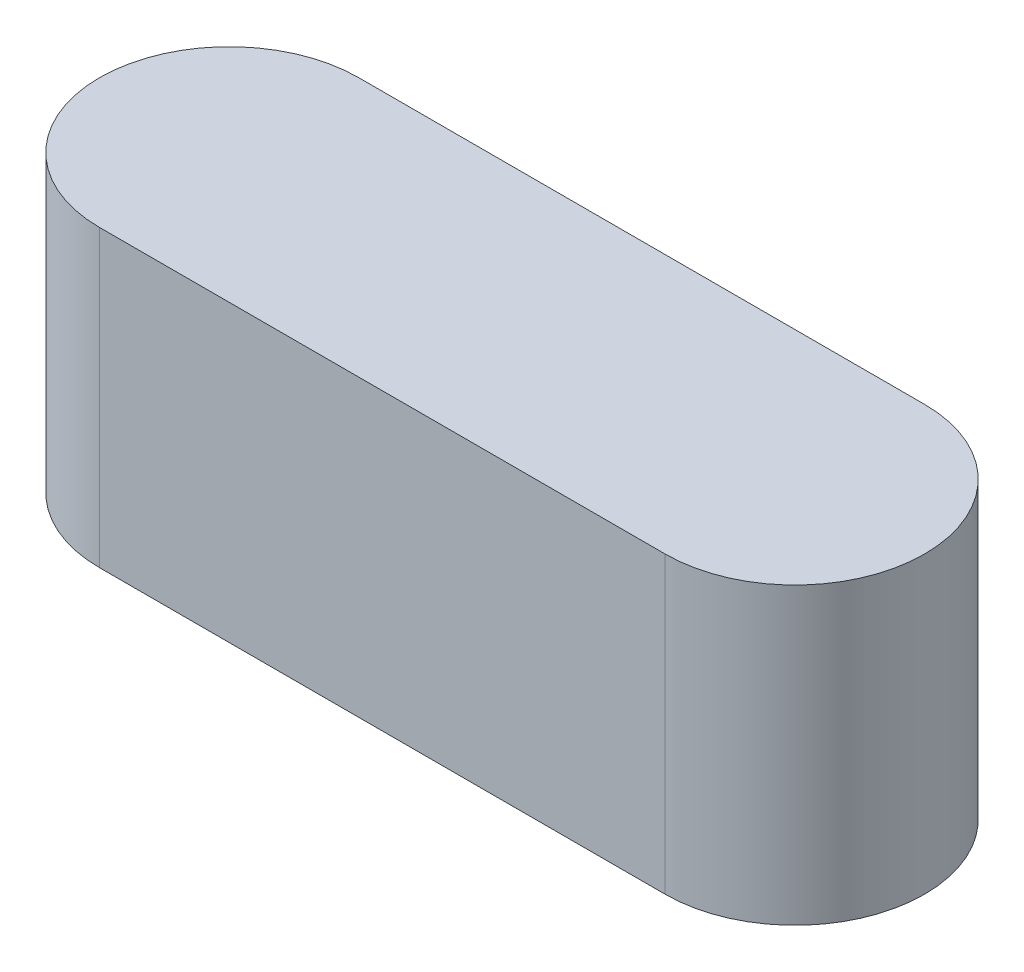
from build123d import *

# Parameters (mm, degrees)
EXTRUDE_1_DEPTH = 25


with BuildPart() as part:
    # Sketch2 → Extrude 1 (new body)
    with BuildSketch(Plane(origin=(0, 0, 0), x_dir=(1, 0, 0), z_dir=(0, 1, 0))):
        with BuildLine():
            Line((24, -11), (-24, -11))
            ThreePointArc((-24, -11), (-35, 0), (-24, 11))
            Line((-24, 11), (24, 11))
            ThreePointArc((24, 11), (35, 0), (24, -11))
        make_face()
    extrude(amount=EXTRUDE_1_DEPTH)


solid = part.part
